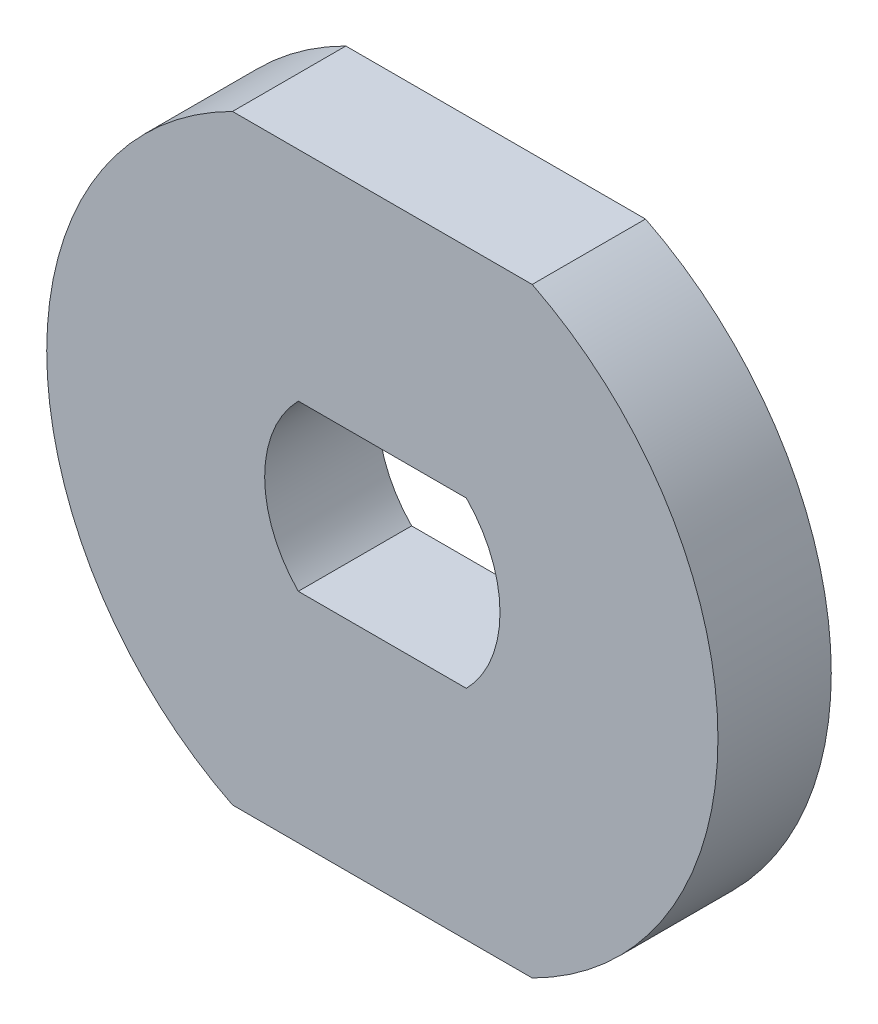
ISO-10303-21;
HEADER;
FILE_DESCRIPTION(('STEP AP214'),'2;1');
FILE_NAME('part.step','',(''),(''),'','','');
FILE_SCHEMA(('AUTOMOTIVE_DESIGN { 1 0 10303 214 1 1 1 1 }'));
ENDSEC;
DATA;
#1=APPLICATION_CONTEXT('core data for automotive mechanical design processes');
#2=APPLICATION_PROTOCOL_DEFINITION('international standard','automotive_design',2000,#1);
#3=PRODUCT_CONTEXT('',#1,'mechanical');
#4=PRODUCT('Part','Part','',(#3));
#5=PRODUCT_RELATED_PRODUCT_CATEGORY('part','',(#4));
#6=PRODUCT_DEFINITION_FORMATION('','',#4);
#7=PRODUCT_DEFINITION_CONTEXT('part definition',#1,'design');
#8=PRODUCT_DEFINITION('design','',#6,#7);
#9=PRODUCT_DEFINITION_SHAPE('','',#8);
#10=(LENGTH_UNIT() NAMED_UNIT(*) SI_UNIT(.MILLI.,.METRE.));
#11=(NAMED_UNIT(*) PLANE_ANGLE_UNIT() SI_UNIT($,.RADIAN.));
#12=(NAMED_UNIT(*) SI_UNIT($,.STERADIAN.) SOLID_ANGLE_UNIT());
#13=UNCERTAINTY_MEASURE_WITH_UNIT(LENGTH_MEASURE(1.E-05),#10,'distance_accuracy_value','');
#14=(GEOMETRIC_REPRESENTATION_CONTEXT(3) GLOBAL_UNCERTAINTY_ASSIGNED_CONTEXT((#13)) GLOBAL_UNIT_ASSIGNED_CONTEXT((#10,
#11,#12)) REPRESENTATION_CONTEXT('',''));
#15=CARTESIAN_POINT('',(0.,0.,0.));
#16=DIRECTION('',(0.,0.,1.));
#17=DIRECTION('',(1.,0.,0.));
#18=AXIS2_PLACEMENT_3D('',#15,#16,#17);
#19=CARTESIAN_POINT('',(-11.5,16.5894442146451,2.6));
#20=DIRECTION('',(0.,0.,1.));
#21=DIRECTION('',(1.,0.,0.));
#22=AXIS2_PLACEMENT_3D('',#19,#20,#21);
#23=PLANE('',#22);
#24=CARTESIAN_POINT('',(-11.5,16.5894442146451,2.6));
#25=DIRECTION('',(0.,0.,1.));
#26=DIRECTION('',(1.,0.,0.));
#27=AXIS2_PLACEMENT_3D('',#24,#25,#26);
#28=CIRCLE('',#27,7.7);
#29=CARTESIAN_POINT('',(-14.9377172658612,23.4794442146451,2.6));
#30=VERTEX_POINT('',#29);
#31=CARTESIAN_POINT('',(-14.9377172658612,9.69944421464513,2.6));
#32=VERTEX_POINT('',#31);
#33=EDGE_CURVE('E134',#30,#32,#28,.T.);
#34=ORIENTED_EDGE('',*,*,#33,.T.);
#35=DIRECTION('',(1.,0.,0.));
#36=VECTOR('',#35,1.);
#37=CARTESIAN_POINT('',(-14.9377172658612,9.69944421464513,2.6));
#38=LINE('',#37,#36);
#39=CARTESIAN_POINT('',(-8.06228273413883,9.69944421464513,2.6));
#40=VERTEX_POINT('',#39);
#41=EDGE_CURVE('E137',#32,#40,#38,.T.);
#42=ORIENTED_EDGE('',*,*,#41,.T.);
#43=CARTESIAN_POINT('',(-11.5,16.5894442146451,2.6));
#44=DIRECTION('',(0.,0.,1.));
#45=DIRECTION('',(1.,0.,0.));
#46=AXIS2_PLACEMENT_3D('',#43,#44,#45);
#47=CIRCLE('',#46,7.7);
#48=CARTESIAN_POINT('',(-8.06228273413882,23.4794442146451,2.6));
#49=VERTEX_POINT('',#48);
#50=EDGE_CURVE('E140',#40,#49,#47,.T.);
#51=ORIENTED_EDGE('',*,*,#50,.T.);
#52=DIRECTION('',(-1.,0.,0.));
#53=VECTOR('',#52,1.);
#54=CARTESIAN_POINT('',(-14.9377172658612,23.4794442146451,2.6));
#55=LINE('',#54,#53);
#56=EDGE_CURVE('E142',#49,#30,#55,.T.);
#57=ORIENTED_EDGE('',*,*,#56,.T.);
#58=EDGE_LOOP('',(#34,#42,#51,#57));
#59=FACE_BOUND('',#58,.T.);
#60=DIRECTION('',(-1.,0.,0.));
#61=VECTOR('',#60,1.);
#62=CARTESIAN_POINT('',(-13.4281856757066,18.4794442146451,2.6));
#63=LINE('',#62,#61);
#64=CARTESIAN_POINT('',(-9.57181432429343,18.4794442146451,2.6));
#65=VERTEX_POINT('',#64);
#66=CARTESIAN_POINT('',(-13.4281856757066,18.4794442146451,2.6));
#67=VERTEX_POINT('',#66);
#68=EDGE_CURVE('E106',#65,#67,#63,.T.);
#69=ORIENTED_EDGE('',*,*,#68,.F.);
#70=CARTESIAN_POINT('',(-11.5,16.5894442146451,2.6));
#71=DIRECTION('',(0.,0.,1.));
#72=DIRECTION('',(1.,0.,0.));
#73=AXIS2_PLACEMENT_3D('',#70,#71,#72);
#74=CIRCLE('',#73,2.7);
#75=CARTESIAN_POINT('',(-9.57181432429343,14.6994442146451,2.6));
#76=VERTEX_POINT('',#75);
#77=EDGE_CURVE('E98',#76,#65,#74,.T.);
#78=ORIENTED_EDGE('',*,*,#77,.F.);
#79=DIRECTION('',(1.,0.,0.));
#80=VECTOR('',#79,1.);
#81=CARTESIAN_POINT('',(-13.4281856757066,14.6994442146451,2.6));
#82=LINE('',#81,#80);
#83=CARTESIAN_POINT('',(-13.4281856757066,14.6994442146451,2.6));
#84=VERTEX_POINT('',#83);
#85=EDGE_CURVE('E120',#84,#76,#82,.T.);
#86=ORIENTED_EDGE('',*,*,#85,.F.);
#87=CARTESIAN_POINT('',(-11.5,16.5894442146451,2.6));
#88=DIRECTION('',(0.,0.,1.));
#89=DIRECTION('',(1.,0.,0.));
#90=AXIS2_PLACEMENT_3D('',#87,#88,#89);
#91=CIRCLE('',#90,2.7);
#92=EDGE_CURVE('E118',#67,#84,#91,.T.);
#93=ORIENTED_EDGE('',*,*,#92,.F.);
#94=EDGE_LOOP('',(#69,#78,#86,#93));
#95=FACE_BOUND('',#94,.T.);
#96=ADVANCED_FACE('F33',(#59,#95),#23,.T.);
#97=CARTESIAN_POINT('',(-11.5,16.5894442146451,0.));
#98=DIRECTION('',(0.,0.,1.));
#99=DIRECTION('',(1.,0.,0.));
#100=AXIS2_PLACEMENT_3D('',#97,#98,#99);
#101=PLANE('',#100);
#102=CARTESIAN_POINT('',(-11.5,16.5894442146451,0.));
#103=DIRECTION('',(0.,0.,1.));
#104=DIRECTION('',(1.,0.,0.));
#105=AXIS2_PLACEMENT_3D('',#102,#103,#104);
#106=CIRCLE('',#105,7.7);
#107=CARTESIAN_POINT('',(-14.9377172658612,23.4794442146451,0.));
#108=VERTEX_POINT('',#107);
#109=CARTESIAN_POINT('',(-14.9377172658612,9.69944421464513,0.));
#110=VERTEX_POINT('',#109);
#111=EDGE_CURVE('E114',#108,#110,#106,.T.);
#112=ORIENTED_EDGE('',*,*,#111,.F.);
#113=DIRECTION('',(-1.,0.,0.));
#114=VECTOR('',#113,1.);
#115=CARTESIAN_POINT('',(-14.9377172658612,23.4794442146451,0.));
#116=LINE('',#115,#114);
#117=CARTESIAN_POINT('',(-8.06228273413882,23.4794442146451,0.));
#118=VERTEX_POINT('',#117);
#119=EDGE_CURVE('E138',#118,#108,#116,.T.);
#120=ORIENTED_EDGE('',*,*,#119,.F.);
#121=CARTESIAN_POINT('',(-11.5,16.5894442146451,0.));
#122=DIRECTION('',(0.,0.,1.));
#123=DIRECTION('',(1.,0.,0.));
#124=AXIS2_PLACEMENT_3D('',#121,#122,#123);
#125=CIRCLE('',#124,7.7);
#126=CARTESIAN_POINT('',(-8.06228273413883,9.69944421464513,0.));
#127=VERTEX_POINT('',#126);
#128=EDGE_CURVE('E149',#127,#118,#125,.T.);
#129=ORIENTED_EDGE('',*,*,#128,.F.);
#130=DIRECTION('',(1.,0.,0.));
#131=VECTOR('',#130,1.);
#132=CARTESIAN_POINT('',(-14.9377172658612,9.69944421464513,0.));
#133=LINE('',#132,#131);
#134=EDGE_CURVE('E147',#110,#127,#133,.T.);
#135=ORIENTED_EDGE('',*,*,#134,.F.);
#136=EDGE_LOOP('',(#112,#120,#129,#135));
#137=FACE_BOUND('',#136,.T.);
#138=CARTESIAN_POINT('',(-11.5,16.5894442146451,0.));
#139=DIRECTION('',(0.,0.,1.));
#140=DIRECTION('',(1.,0.,0.));
#141=AXIS2_PLACEMENT_3D('',#138,#139,#140);
#142=CIRCLE('',#141,2.7);
#143=CARTESIAN_POINT('',(-9.57181432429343,14.6994442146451,0.));
#144=VERTEX_POINT('',#143);
#145=CARTESIAN_POINT('',(-9.57181432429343,18.4794442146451,0.));
#146=VERTEX_POINT('',#145);
#147=EDGE_CURVE('E56',#144,#146,#142,.T.);
#148=ORIENTED_EDGE('',*,*,#147,.T.);
#149=DIRECTION('',(-1.,0.,0.));
#150=VECTOR('',#149,1.);
#151=CARTESIAN_POINT('',(-13.4281856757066,18.4794442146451,0.));
#152=LINE('',#151,#150);
#153=CARTESIAN_POINT('',(-13.4281856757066,18.4794442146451,0.));
#154=VERTEX_POINT('',#153);
#155=EDGE_CURVE('E113',#146,#154,#152,.T.);
#156=ORIENTED_EDGE('',*,*,#155,.T.);
#157=CARTESIAN_POINT('',(-11.5,16.5894442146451,0.));
#158=DIRECTION('',(0.,0.,1.));
#159=DIRECTION('',(1.,0.,0.));
#160=AXIS2_PLACEMENT_3D('',#157,#158,#159);
#161=CIRCLE('',#160,2.7);
#162=CARTESIAN_POINT('',(-13.4281856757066,14.6994442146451,0.));
#163=VERTEX_POINT('',#162);
#164=EDGE_CURVE('E126',#154,#163,#161,.T.);
#165=ORIENTED_EDGE('',*,*,#164,.T.);
#166=DIRECTION('',(1.,0.,0.));
#167=VECTOR('',#166,1.);
#168=CARTESIAN_POINT('',(-13.4281856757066,14.6994442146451,0.));
#169=LINE('',#168,#167);
#170=EDGE_CURVE('E107',#163,#144,#169,.T.);
#171=ORIENTED_EDGE('',*,*,#170,.T.);
#172=EDGE_LOOP('',(#148,#156,#165,#171));
#173=FACE_BOUND('',#172,.T.);
#174=ADVANCED_FACE('F167',(#137,#173),#101,.F.);
#175=CARTESIAN_POINT('',(-11.5,16.5894442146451,2.6));
#176=DIRECTION('',(0.,0.,-1.));
#177=DIRECTION('',(-1.,0.,0.));
#178=AXIS2_PLACEMENT_3D('',#175,#176,#177);
#179=CYLINDRICAL_SURFACE('',#178,7.7);
#180=ORIENTED_EDGE('',*,*,#111,.T.);
#181=DIRECTION('',(0.,0.,-1.));
#182=VECTOR('',#181,1.);
#183=CARTESIAN_POINT('',(-14.9377172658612,9.69944421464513,2.6));
#184=LINE('',#183,#182);
#185=EDGE_CURVE('E11',#32,#110,#184,.T.);
#186=ORIENTED_EDGE('',*,*,#185,.F.);
#187=ORIENTED_EDGE('',*,*,#33,.F.);
#188=DIRECTION('',(0.,0.,-1.));
#189=VECTOR('',#188,1.);
#190=CARTESIAN_POINT('',(-14.9377172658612,23.4794442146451,2.6));
#191=LINE('',#190,#189);
#192=EDGE_CURVE('E144',#30,#108,#191,.T.);
#193=ORIENTED_EDGE('',*,*,#192,.T.);
#194=EDGE_LOOP('',(#180,#186,#187,#193));
#195=FACE_BOUND('',#194,.T.);
#196=ADVANCED_FACE('F35',(#195),#179,.T.);
#197=CARTESIAN_POINT('',(-14.9377172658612,9.69944421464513,2.6));
#198=DIRECTION('',(0.,1.,0.));
#199=DIRECTION('',(0.,0.,1.));
#200=AXIS2_PLACEMENT_3D('',#197,#198,#199);
#201=PLANE('',#200);
#202=ORIENTED_EDGE('',*,*,#134,.T.);
#203=DIRECTION('',(0.,0.,-1.));
#204=VECTOR('',#203,1.);
#205=CARTESIAN_POINT('',(-8.06228273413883,9.69944421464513,2.6));
#206=LINE('',#205,#204);
#207=EDGE_CURVE('E41',#40,#127,#206,.T.);
#208=ORIENTED_EDGE('',*,*,#207,.F.);
#209=ORIENTED_EDGE('',*,*,#41,.F.);
#210=ORIENTED_EDGE('',*,*,#185,.T.);
#211=EDGE_LOOP('',(#202,#208,#209,#210));
#212=FACE_BOUND('',#211,.T.);
#213=ADVANCED_FACE('F177',(#212),#201,.F.);
#214=CARTESIAN_POINT('',(-11.5,16.5894442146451,2.6));
#215=DIRECTION('',(0.,0.,-1.));
#216=DIRECTION('',(-1.,0.,0.));
#217=AXIS2_PLACEMENT_3D('',#214,#215,#216);
#218=CYLINDRICAL_SURFACE('',#217,7.7);
#219=ORIENTED_EDGE('',*,*,#128,.T.);
#220=DIRECTION('',(0.,0.,-1.));
#221=VECTOR('',#220,1.);
#222=CARTESIAN_POINT('',(-8.06228273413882,23.4794442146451,2.6));
#223=LINE('',#222,#221);
#224=EDGE_CURVE('E154',#49,#118,#223,.T.);
#225=ORIENTED_EDGE('',*,*,#224,.F.);
#226=ORIENTED_EDGE('',*,*,#50,.F.);
#227=ORIENTED_EDGE('',*,*,#207,.T.);
#228=EDGE_LOOP('',(#219,#225,#226,#227));
#229=FACE_BOUND('',#228,.T.);
#230=ADVANCED_FACE('F161',(#229),#218,.T.);
#231=CARTESIAN_POINT('',(-14.9377172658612,23.4794442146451,2.6));
#232=DIRECTION('',(0.,-1.,0.));
#233=DIRECTION('',(0.,0.,-1.));
#234=AXIS2_PLACEMENT_3D('',#231,#232,#233);
#235=PLANE('',#234);
#236=ORIENTED_EDGE('',*,*,#119,.T.);
#237=ORIENTED_EDGE('',*,*,#192,.F.);
#238=ORIENTED_EDGE('',*,*,#56,.F.);
#239=ORIENTED_EDGE('',*,*,#224,.T.);
#240=EDGE_LOOP('',(#236,#237,#238,#239));
#241=FACE_BOUND('',#240,.T.);
#242=ADVANCED_FACE('F171',(#241),#235,.F.);
#243=CARTESIAN_POINT('',(-11.5,16.5894442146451,2.6));
#244=DIRECTION('',(0.,0.,-1.));
#245=DIRECTION('',(-1.,0.,0.));
#246=AXIS2_PLACEMENT_3D('',#243,#244,#245);
#247=CYLINDRICAL_SURFACE('',#246,2.7);
#248=ORIENTED_EDGE('',*,*,#147,.F.);
#249=DIRECTION('',(0.,0.,-1.));
#250=VECTOR('',#249,1.);
#251=CARTESIAN_POINT('',(-9.57181432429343,14.6994442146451,2.6));
#252=LINE('',#251,#250);
#253=EDGE_CURVE('E102',#76,#144,#252,.T.);
#254=ORIENTED_EDGE('',*,*,#253,.F.);
#255=ORIENTED_EDGE('',*,*,#77,.T.);
#256=DIRECTION('',(0.,0.,-1.));
#257=VECTOR('',#256,1.);
#258=CARTESIAN_POINT('',(-9.57181432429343,18.4794442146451,2.6));
#259=LINE('',#258,#257);
#260=EDGE_CURVE('E101',#65,#146,#259,.T.);
#261=ORIENTED_EDGE('',*,*,#260,.T.);
#262=EDGE_LOOP('',(#248,#254,#255,#261));
#263=FACE_BOUND('',#262,.T.);
#264=ADVANCED_FACE('F100',(#263),#247,.F.);
#265=CARTESIAN_POINT('',(-13.4281856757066,18.4794442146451,2.6));
#266=DIRECTION('',(0.,-1.,0.));
#267=DIRECTION('',(0.,0.,-1.));
#268=AXIS2_PLACEMENT_3D('',#265,#266,#267);
#269=PLANE('',#268);
#270=ORIENTED_EDGE('',*,*,#155,.F.);
#271=ORIENTED_EDGE('',*,*,#260,.F.);
#272=ORIENTED_EDGE('',*,*,#68,.T.);
#273=DIRECTION('',(0.,0.,-1.));
#274=VECTOR('',#273,1.);
#275=CARTESIAN_POINT('',(-13.4281856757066,18.4794442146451,2.6));
#276=LINE('',#275,#274);
#277=EDGE_CURVE('E115',#67,#154,#276,.T.);
#278=ORIENTED_EDGE('',*,*,#277,.T.);
#279=EDGE_LOOP('',(#270,#271,#272,#278));
#280=FACE_BOUND('',#279,.T.);
#281=ADVANCED_FACE('F110',(#280),#269,.T.);
#282=CARTESIAN_POINT('',(-11.5,16.5894442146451,2.6));
#283=DIRECTION('',(0.,0.,-1.));
#284=DIRECTION('',(-1.,0.,0.));
#285=AXIS2_PLACEMENT_3D('',#282,#283,#284);
#286=CYLINDRICAL_SURFACE('',#285,2.7);
#287=ORIENTED_EDGE('',*,*,#164,.F.);
#288=ORIENTED_EDGE('',*,*,#277,.F.);
#289=ORIENTED_EDGE('',*,*,#92,.T.);
#290=DIRECTION('',(0.,0.,-1.));
#291=VECTOR('',#290,1.);
#292=CARTESIAN_POINT('',(-13.4281856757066,14.6994442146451,2.6));
#293=LINE('',#292,#291);
#294=EDGE_CURVE('E48',#84,#163,#293,.T.);
#295=ORIENTED_EDGE('',*,*,#294,.T.);
#296=EDGE_LOOP('',(#287,#288,#289,#295));
#297=FACE_BOUND('',#296,.T.);
#298=ADVANCED_FACE('F200',(#297),#286,.F.);
#299=CARTESIAN_POINT('',(-13.4281856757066,14.6994442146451,2.6));
#300=DIRECTION('',(0.,1.,0.));
#301=DIRECTION('',(0.,0.,1.));
#302=AXIS2_PLACEMENT_3D('',#299,#300,#301);
#303=PLANE('',#302);
#304=ORIENTED_EDGE('',*,*,#170,.F.);
#305=ORIENTED_EDGE('',*,*,#294,.F.);
#306=ORIENTED_EDGE('',*,*,#85,.T.);
#307=ORIENTED_EDGE('',*,*,#253,.T.);
#308=EDGE_LOOP('',(#304,#305,#306,#307));
#309=FACE_BOUND('',#308,.T.);
#310=ADVANCED_FACE('F204',(#309),#303,.T.);
#311=CLOSED_SHELL('',(#96,#174,#196,#213,#230,#242,#264,#281,#298,#310));
#312=MANIFOLD_SOLID_BREP('B2',#311);
#313=ADVANCED_BREP_SHAPE_REPRESENTATION('',(#18,#312),#14);
#314=SHAPE_DEFINITION_REPRESENTATION(#9,#313);
ENDSEC;
END-ISO-10303-21;
